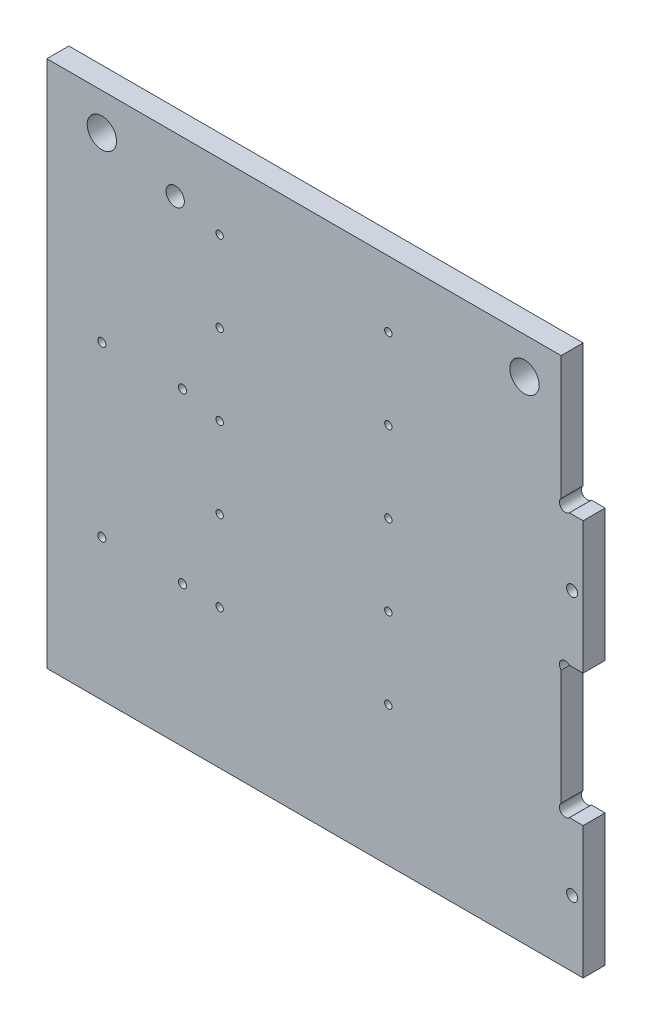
ISO-10303-21;
HEADER;
FILE_DESCRIPTION(('STEP AP214'),'2;1');
FILE_NAME('part.step','',(''),(''),'','','');
FILE_SCHEMA(('AUTOMOTIVE_DESIGN { 1 0 10303 214 1 1 1 1 }'));
ENDSEC;
DATA;
#1=APPLICATION_CONTEXT('core data for automotive mechanical design processes');
#2=APPLICATION_PROTOCOL_DEFINITION('international standard','automotive_design',2000,#1);
#3=PRODUCT_CONTEXT('',#1,'mechanical');
#4=PRODUCT('Part','Part','',(#3));
#5=PRODUCT_RELATED_PRODUCT_CATEGORY('part','',(#4));
#6=PRODUCT_DEFINITION_FORMATION('','',#4);
#7=PRODUCT_DEFINITION_CONTEXT('part definition',#1,'design');
#8=PRODUCT_DEFINITION('design','',#6,#7);
#9=PRODUCT_DEFINITION_SHAPE('','',#8);
#10=(LENGTH_UNIT() NAMED_UNIT(*) SI_UNIT(.MILLI.,.METRE.));
#11=(NAMED_UNIT(*) PLANE_ANGLE_UNIT() SI_UNIT($,.RADIAN.));
#12=(NAMED_UNIT(*) SI_UNIT($,.STERADIAN.) SOLID_ANGLE_UNIT());
#13=UNCERTAINTY_MEASURE_WITH_UNIT(LENGTH_MEASURE(1.E-05),#10,'distance_accuracy_value','');
#14=(GEOMETRIC_REPRESENTATION_CONTEXT(3) GLOBAL_UNCERTAINTY_ASSIGNED_CONTEXT((#13)) GLOBAL_UNIT_ASSIGNED_CONTEXT((#10,
#11,#12)) REPRESENTATION_CONTEXT('',''));
#15=CARTESIAN_POINT('',(0.,0.,0.));
#16=DIRECTION('',(0.,0.,1.));
#17=DIRECTION('',(1.,0.,0.));
#18=AXIS2_PLACEMENT_3D('',#15,#16,#17);
#19=CARTESIAN_POINT('',(0.,0.,6.));
#20=DIRECTION('',(0.,1.,0.));
#21=DIRECTION('',(-1.,0.,0.));
#22=AXIS2_PLACEMENT_3D('',#19,#20,#21);
#23=PLANE('',#22);
#24=DIRECTION('',(1.,0.,0.));
#25=VECTOR('',#24,1.);
#26=CARTESIAN_POINT('',(0.,0.,0.));
#27=LINE('',#26,#25);
#28=CARTESIAN_POINT('',(0.,0.,0.));
#29=VERTEX_POINT('',#28);
#30=CARTESIAN_POINT('',(146.25,0.,0.));
#31=VERTEX_POINT('',#30);
#32=EDGE_CURVE('E235',#29,#31,#27,.T.);
#33=ORIENTED_EDGE('',*,*,#32,.T.);
#34=DIRECTION('',(0.,0.,-1.));
#35=VECTOR('',#34,1.);
#36=CARTESIAN_POINT('',(146.25,0.,6.));
#37=LINE('',#36,#35);
#38=CARTESIAN_POINT('',(146.25,0.,6.));
#39=VERTEX_POINT('',#38);
#40=EDGE_CURVE('E194',#39,#31,#37,.T.);
#41=ORIENTED_EDGE('',*,*,#40,.F.);
#42=DIRECTION('',(1.,0.,0.));
#43=VECTOR('',#42,1.);
#44=CARTESIAN_POINT('',(0.,0.,6.));
#45=LINE('',#44,#43);
#46=CARTESIAN_POINT('',(0.,0.,6.));
#47=VERTEX_POINT('',#46);
#48=EDGE_CURVE('E156',#47,#39,#45,.T.);
#49=ORIENTED_EDGE('',*,*,#48,.F.);
#50=DIRECTION('',(0.,0.,-1.));
#51=VECTOR('',#50,1.);
#52=CARTESIAN_POINT('',(0.,0.,6.));
#53=LINE('',#52,#51);
#54=EDGE_CURVE('E176',#47,#29,#53,.T.);
#55=ORIENTED_EDGE('',*,*,#54,.T.);
#56=EDGE_LOOP('',(#33,#41,#49,#55));
#57=FACE_BOUND('',#56,.T.);
#58=ADVANCED_FACE('F26',(#57),#23,.F.);
#59=CARTESIAN_POINT('',(146.25,36.,6.));
#60=DIRECTION('',(-1.,0.,0.));
#61=DIRECTION('',(0.,0.,1.));
#62=AXIS2_PLACEMENT_3D('',#59,#60,#61);
#63=PLANE('',#62);
#64=DIRECTION('',(0.,1.,0.));
#65=VECTOR('',#64,1.);
#66=CARTESIAN_POINT('',(146.25,36.,0.));
#67=LINE('',#66,#65);
#68=CARTESIAN_POINT('',(146.25,36.,0.));
#69=VERTEX_POINT('',#68);
#70=EDGE_CURVE('E142',#31,#69,#67,.T.);
#71=ORIENTED_EDGE('',*,*,#70,.T.);
#72=DIRECTION('',(0.,0.,-1.));
#73=VECTOR('',#72,1.);
#74=CARTESIAN_POINT('',(146.25,36.,6.));
#75=LINE('',#74,#73);
#76=CARTESIAN_POINT('',(146.25,36.,6.));
#77=VERTEX_POINT('',#76);
#78=EDGE_CURVE('E191',#77,#69,#75,.T.);
#79=ORIENTED_EDGE('',*,*,#78,.F.);
#80=DIRECTION('',(0.,1.,0.));
#81=VECTOR('',#80,1.);
#82=CARTESIAN_POINT('',(146.25,36.,6.));
#83=LINE('',#82,#81);
#84=EDGE_CURVE('E158',#39,#77,#83,.T.);
#85=ORIENTED_EDGE('',*,*,#84,.F.);
#86=ORIENTED_EDGE('',*,*,#40,.T.);
#87=EDGE_LOOP('',(#71,#79,#85,#86));
#88=FACE_BOUND('',#87,.T.);
#89=ADVANCED_FACE('F239',(#88),#63,.F.);
#90=CARTESIAN_POINT('',(140.25,36.,6.));
#91=DIRECTION('',(0.,-1.,0.));
#92=DIRECTION('',(1.,0.,0.));
#93=AXIS2_PLACEMENT_3D('',#90,#91,#92);
#94=PLANE('',#93);
#95=DIRECTION('',(-1.,0.,0.));
#96=VECTOR('',#95,1.);
#97=CARTESIAN_POINT('',(140.25,36.,0.));
#98=LINE('',#97,#96);
#99=CARTESIAN_POINT('',(142.512741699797,36.,0.));
#100=VERTEX_POINT('',#99);
#101=EDGE_CURVE('E138',#69,#100,#98,.T.);
#102=ORIENTED_EDGE('',*,*,#101,.T.);
#103=DIRECTION('',(0.,0.,1.));
#104=VECTOR('',#103,1.);
#105=CARTESIAN_POINT('',(142.512741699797,36.,0.));
#106=LINE('',#105,#104);
#107=CARTESIAN_POINT('',(142.512741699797,36.,6.));
#108=VERTEX_POINT('',#107);
#109=EDGE_CURVE('E126',#100,#108,#106,.T.);
#110=ORIENTED_EDGE('',*,*,#109,.T.);
#111=DIRECTION('',(-1.,0.,0.));
#112=VECTOR('',#111,1.);
#113=CARTESIAN_POINT('',(140.25,36.,6.));
#114=LINE('',#113,#112);
#115=EDGE_CURVE('E160',#77,#108,#114,.T.);
#116=ORIENTED_EDGE('',*,*,#115,.F.);
#117=ORIENTED_EDGE('',*,*,#78,.T.);
#118=EDGE_LOOP('',(#102,#110,#116,#117));
#119=FACE_BOUND('',#118,.T.);
#120=ADVANCED_FACE('F244',(#119),#94,.F.);
#121=CARTESIAN_POINT('',(140.25,72.,6.));
#122=DIRECTION('',(-1.,0.,0.));
#123=DIRECTION('',(0.,0.,1.));
#124=AXIS2_PLACEMENT_3D('',#121,#122,#123);
#125=PLANE('',#124);
#126=DIRECTION('',(0.,1.,0.));
#127=VECTOR('',#126,1.);
#128=CARTESIAN_POINT('',(140.25,72.,6.));
#129=LINE('',#128,#127);
#130=CARTESIAN_POINT('',(140.25,38.262741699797,6.));
#131=VERTEX_POINT('',#130);
#132=CARTESIAN_POINT('',(140.25,69.737258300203,6.));
#133=VERTEX_POINT('',#132);
#134=EDGE_CURVE('E131',#131,#133,#129,.T.);
#135=ORIENTED_EDGE('',*,*,#134,.F.);
#136=DIRECTION('',(0.,0.,1.));
#137=VECTOR('',#136,1.);
#138=CARTESIAN_POINT('',(140.25,38.262741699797,0.));
#139=LINE('',#138,#137);
#140=CARTESIAN_POINT('',(140.25,38.262741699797,0.));
#141=VERTEX_POINT('',#140);
#142=EDGE_CURVE('E123',#131,#141,#139,.F.);
#143=ORIENTED_EDGE('',*,*,#142,.T.);
#144=DIRECTION('',(0.,1.,0.));
#145=VECTOR('',#144,1.);
#146=CARTESIAN_POINT('',(140.25,72.,0.));
#147=LINE('',#146,#145);
#148=CARTESIAN_POINT('',(140.25,69.737258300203,0.));
#149=VERTEX_POINT('',#148);
#150=EDGE_CURVE('E40',#141,#149,#147,.T.);
#151=ORIENTED_EDGE('',*,*,#150,.T.);
#152=DIRECTION('',(0.,0.,1.));
#153=VECTOR('',#152,1.);
#154=CARTESIAN_POINT('',(140.25,69.737258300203,0.));
#155=LINE('',#154,#153);
#156=EDGE_CURVE('E205',#149,#133,#155,.T.);
#157=ORIENTED_EDGE('',*,*,#156,.T.);
#158=EDGE_LOOP('',(#135,#143,#151,#157));
#159=FACE_BOUND('',#158,.T.);
#160=ADVANCED_FACE('F130',(#159),#125,.F.);
#161=CARTESIAN_POINT('',(146.25,72.,6.));
#162=DIRECTION('',(0.,1.,0.));
#163=DIRECTION('',(-1.,0.,0.));
#164=AXIS2_PLACEMENT_3D('',#161,#162,#163);
#165=PLANE('',#164);
#166=DIRECTION('',(1.,0.,0.));
#167=VECTOR('',#166,1.);
#168=CARTESIAN_POINT('',(146.25,72.,6.));
#169=LINE('',#168,#167);
#170=CARTESIAN_POINT('',(142.512741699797,72.,6.));
#171=VERTEX_POINT('',#170);
#172=CARTESIAN_POINT('',(146.25,72.,6.));
#173=VERTEX_POINT('',#172);
#174=EDGE_CURVE('E164',#171,#173,#169,.T.);
#175=ORIENTED_EDGE('',*,*,#174,.F.);
#176=DIRECTION('',(0.,0.,1.));
#177=VECTOR('',#176,1.);
#178=CARTESIAN_POINT('',(142.512741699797,72.,0.));
#179=LINE('',#178,#177);
#180=CARTESIAN_POINT('',(142.512741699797,72.,0.));
#181=VERTEX_POINT('',#180);
#182=EDGE_CURVE('E203',#171,#181,#179,.F.);
#183=ORIENTED_EDGE('',*,*,#182,.T.);
#184=DIRECTION('',(1.,0.,0.));
#185=VECTOR('',#184,1.);
#186=CARTESIAN_POINT('',(146.25,72.,0.));
#187=LINE('',#186,#185);
#188=CARTESIAN_POINT('',(146.25,72.,0.));
#189=VERTEX_POINT('',#188);
#190=EDGE_CURVE('E137',#181,#189,#187,.T.);
#191=ORIENTED_EDGE('',*,*,#190,.T.);
#192=DIRECTION('',(0.,0.,-1.));
#193=VECTOR('',#192,1.);
#194=CARTESIAN_POINT('',(146.25,72.,6.));
#195=LINE('',#194,#193);
#196=EDGE_CURVE('E188',#173,#189,#195,.T.);
#197=ORIENTED_EDGE('',*,*,#196,.F.);
#198=EDGE_LOOP('',(#175,#183,#191,#197));
#199=FACE_BOUND('',#198,.T.);
#200=ADVANCED_FACE('F207',(#199),#165,.F.);
#201=CARTESIAN_POINT('',(146.25,108.,6.));
#202=DIRECTION('',(-1.,0.,0.));
#203=DIRECTION('',(0.,0.,1.));
#204=AXIS2_PLACEMENT_3D('',#201,#202,#203);
#205=PLANE('',#204);
#206=DIRECTION('',(0.,1.,0.));
#207=VECTOR('',#206,1.);
#208=CARTESIAN_POINT('',(146.25,108.,0.));
#209=LINE('',#208,#207);
#210=CARTESIAN_POINT('',(146.25,108.,0.));
#211=VERTEX_POINT('',#210);
#212=EDGE_CURVE('E140',#189,#211,#209,.T.);
#213=ORIENTED_EDGE('',*,*,#212,.T.);
#214=DIRECTION('',(0.,0.,-1.));
#215=VECTOR('',#214,1.);
#216=CARTESIAN_POINT('',(146.25,108.,6.));
#217=LINE('',#216,#215);
#218=CARTESIAN_POINT('',(146.25,108.,6.));
#219=VERTEX_POINT('',#218);
#220=EDGE_CURVE('E185',#219,#211,#217,.T.);
#221=ORIENTED_EDGE('',*,*,#220,.F.);
#222=DIRECTION('',(0.,1.,0.));
#223=VECTOR('',#222,1.);
#224=CARTESIAN_POINT('',(146.25,108.,6.));
#225=LINE('',#224,#223);
#226=EDGE_CURVE('E166',#173,#219,#225,.T.);
#227=ORIENTED_EDGE('',*,*,#226,.F.);
#228=ORIENTED_EDGE('',*,*,#196,.T.);
#229=EDGE_LOOP('',(#213,#221,#227,#228));
#230=FACE_BOUND('',#229,.T.);
#231=ADVANCED_FACE('F216',(#230),#205,.F.);
#232=CARTESIAN_POINT('',(140.25,108.,6.));
#233=DIRECTION('',(0.,-1.,0.));
#234=DIRECTION('',(1.,0.,0.));
#235=AXIS2_PLACEMENT_3D('',#232,#233,#234);
#236=PLANE('',#235);
#237=DIRECTION('',(-1.,0.,0.));
#238=VECTOR('',#237,1.);
#239=CARTESIAN_POINT('',(140.25,108.,0.));
#240=LINE('',#239,#238);
#241=CARTESIAN_POINT('',(142.512741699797,108.,0.));
#242=VERTEX_POINT('',#241);
#243=EDGE_CURVE('E147',#211,#242,#240,.T.);
#244=ORIENTED_EDGE('',*,*,#243,.T.);
#245=DIRECTION('',(0.,0.,1.));
#246=VECTOR('',#245,1.);
#247=CARTESIAN_POINT('',(142.512741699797,108.,0.));
#248=LINE('',#247,#246);
#249=CARTESIAN_POINT('',(142.512741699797,108.,6.));
#250=VERTEX_POINT('',#249);
#251=EDGE_CURVE('E222',#242,#250,#248,.T.);
#252=ORIENTED_EDGE('',*,*,#251,.T.);
#253=DIRECTION('',(-1.,0.,0.));
#254=VECTOR('',#253,1.);
#255=CARTESIAN_POINT('',(140.25,108.,6.));
#256=LINE('',#255,#254);
#257=EDGE_CURVE('E168',#219,#250,#256,.T.);
#258=ORIENTED_EDGE('',*,*,#257,.F.);
#259=ORIENTED_EDGE('',*,*,#220,.T.);
#260=EDGE_LOOP('',(#244,#252,#258,#259));
#261=FACE_BOUND('',#260,.T.);
#262=ADVANCED_FACE('F220',(#261),#236,.F.);
#263=CARTESIAN_POINT('',(140.25,144.,6.));
#264=DIRECTION('',(-1.,0.,0.));
#265=DIRECTION('',(0.,0.,1.));
#266=AXIS2_PLACEMENT_3D('',#263,#264,#265);
#267=PLANE('',#266);
#268=DIRECTION('',(0.,1.,0.));
#269=VECTOR('',#268,1.);
#270=CARTESIAN_POINT('',(140.25,144.,6.));
#271=LINE('',#270,#269);
#272=CARTESIAN_POINT('',(140.25,110.262741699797,6.));
#273=VERTEX_POINT('',#272);
#274=CARTESIAN_POINT('',(140.25,144.,6.));
#275=VERTEX_POINT('',#274);
#276=EDGE_CURVE('E171',#273,#275,#271,.T.);
#277=ORIENTED_EDGE('',*,*,#276,.F.);
#278=DIRECTION('',(0.,0.,1.));
#279=VECTOR('',#278,1.);
#280=CARTESIAN_POINT('',(140.25,110.262741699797,0.));
#281=LINE('',#280,#279);
#282=CARTESIAN_POINT('',(140.25,110.262741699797,0.));
#283=VERTEX_POINT('',#282);
#284=EDGE_CURVE('E231',#273,#283,#281,.F.);
#285=ORIENTED_EDGE('',*,*,#284,.T.);
#286=DIRECTION('',(0.,1.,0.));
#287=VECTOR('',#286,1.);
#288=CARTESIAN_POINT('',(140.25,144.,0.));
#289=LINE('',#288,#287);
#290=CARTESIAN_POINT('',(140.25,144.,0.));
#291=VERTEX_POINT('',#290);
#292=EDGE_CURVE('E150',#283,#291,#289,.T.);
#293=ORIENTED_EDGE('',*,*,#292,.T.);
#294=DIRECTION('',(0.,0.,-1.));
#295=VECTOR('',#294,1.);
#296=CARTESIAN_POINT('',(140.25,144.,6.));
#297=LINE('',#296,#295);
#298=EDGE_CURVE('E182',#275,#291,#297,.T.);
#299=ORIENTED_EDGE('',*,*,#298,.F.);
#300=EDGE_LOOP('',(#277,#285,#293,#299));
#301=FACE_BOUND('',#300,.T.);
#302=ADVANCED_FACE('F259',(#301),#267,.F.);
#303=CARTESIAN_POINT('',(0.,144.,6.));
#304=DIRECTION('',(0.,-1.,0.));
#305=DIRECTION('',(1.,0.,0.));
#306=AXIS2_PLACEMENT_3D('',#303,#304,#305);
#307=PLANE('',#306);
#308=DIRECTION('',(-1.,0.,0.));
#309=VECTOR('',#308,1.);
#310=CARTESIAN_POINT('',(0.,144.,0.));
#311=LINE('',#310,#309);
#312=CARTESIAN_POINT('',(0.,144.,0.));
#313=VERTEX_POINT('',#312);
#314=EDGE_CURVE('E152',#291,#313,#311,.T.);
#315=ORIENTED_EDGE('',*,*,#314,.T.);
#316=DIRECTION('',(0.,0.,-1.));
#317=VECTOR('',#316,1.);
#318=CARTESIAN_POINT('',(0.,144.,6.));
#319=LINE('',#318,#317);
#320=CARTESIAN_POINT('',(0.,144.,6.));
#321=VERTEX_POINT('',#320);
#322=EDGE_CURVE('E179',#321,#313,#319,.T.);
#323=ORIENTED_EDGE('',*,*,#322,.F.);
#324=DIRECTION('',(-1.,0.,0.));
#325=VECTOR('',#324,1.);
#326=CARTESIAN_POINT('',(0.,144.,6.));
#327=LINE('',#326,#325);
#328=EDGE_CURVE('E173',#275,#321,#327,.T.);
#329=ORIENTED_EDGE('',*,*,#328,.F.);
#330=ORIENTED_EDGE('',*,*,#298,.T.);
#331=EDGE_LOOP('',(#315,#323,#329,#330));
#332=FACE_BOUND('',#331,.T.);
#333=ADVANCED_FACE('F255',(#332),#307,.F.);
#334=CARTESIAN_POINT('',(0.,0.,6.));
#335=DIRECTION('',(1.,0.,0.));
#336=DIRECTION('',(0.,0.,-1.));
#337=AXIS2_PLACEMENT_3D('',#334,#335,#336);
#338=PLANE('',#337);
#339=DIRECTION('',(0.,-1.,0.));
#340=VECTOR('',#339,1.);
#341=CARTESIAN_POINT('',(0.,0.,0.));
#342=LINE('',#341,#340);
#343=EDGE_CURVE('E154',#313,#29,#342,.T.);
#344=ORIENTED_EDGE('',*,*,#343,.T.);
#345=ORIENTED_EDGE('',*,*,#54,.F.);
#346=DIRECTION('',(0.,-1.,0.));
#347=VECTOR('',#346,1.);
#348=CARTESIAN_POINT('',(0.,0.,6.));
#349=LINE('',#348,#347);
#350=EDGE_CURVE('E48',#321,#47,#349,.T.);
#351=ORIENTED_EDGE('',*,*,#350,.F.);
#352=ORIENTED_EDGE('',*,*,#322,.T.);
#353=EDGE_LOOP('',(#344,#345,#351,#352));
#354=FACE_BOUND('',#353,.T.);
#355=ADVANCED_FACE('F251',(#354),#338,.F.);
#356=CARTESIAN_POINT('',(146.25,0.,6.));
#357=DIRECTION('',(0.,0.,-1.));
#358=DIRECTION('',(-1.,0.,0.));
#359=AXIS2_PLACEMENT_3D('',#356,#357,#358);
#360=PLANE('',#359);
#361=CARTESIAN_POINT('',(35.,129.,6.));
#362=DIRECTION('',(0.,0.,-1.));
#363=DIRECTION('',(-1.,0.,0.));
#364=AXIS2_PLACEMENT_3D('',#361,#362,#363);
#365=CIRCLE('',#364,2.5);
#366=CARTESIAN_POINT('',(32.5,129.,6.));
#367=VERTEX_POINT('',#366);
#368=EDGE_CURVE('E302',#367,#367,#365,.T.);
#369=ORIENTED_EDGE('',*,*,#368,.T.);
#370=EDGE_LOOP('',(#369));
#371=FACE_BOUND('',#370,.T.);
#372=CARTESIAN_POINT('',(15.,38.5,6.));
#373=DIRECTION('',(0.,0.,-1.));
#374=DIRECTION('',(-1.,0.,0.));
#375=AXIS2_PLACEMENT_3D('',#372,#373,#374);
#376=CIRCLE('',#375,1.1);
#377=CARTESIAN_POINT('',(13.9,38.5,6.));
#378=VERTEX_POINT('',#377);
#379=EDGE_CURVE('E306',#378,#378,#376,.T.);
#380=ORIENTED_EDGE('',*,*,#379,.T.);
#381=EDGE_LOOP('',(#380));
#382=FACE_BOUND('',#381,.T.);
#383=CARTESIAN_POINT('',(37.,38.5,6.));
#384=DIRECTION('',(0.,0.,-1.));
#385=DIRECTION('',(-1.,0.,0.));
#386=AXIS2_PLACEMENT_3D('',#383,#384,#385);
#387=CIRCLE('',#386,1.1);
#388=CARTESIAN_POINT('',(35.9,38.5,6.));
#389=VERTEX_POINT('',#388);
#390=EDGE_CURVE('E310',#389,#389,#387,.T.);
#391=ORIENTED_EDGE('',*,*,#390,.T.);
#392=EDGE_LOOP('',(#391));
#393=FACE_BOUND('',#392,.T.);
#394=CARTESIAN_POINT('',(37.,84.5,6.));
#395=DIRECTION('',(0.,0.,-1.));
#396=DIRECTION('',(-1.,0.,0.));
#397=AXIS2_PLACEMENT_3D('',#394,#395,#396);
#398=CIRCLE('',#397,1.1);
#399=CARTESIAN_POINT('',(35.9,84.5,6.));
#400=VERTEX_POINT('',#399);
#401=EDGE_CURVE('E314',#400,#400,#398,.T.);
#402=ORIENTED_EDGE('',*,*,#401,.T.);
#403=EDGE_LOOP('',(#402));
#404=FACE_BOUND('',#403,.T.);
#405=CARTESIAN_POINT('',(15.,84.5,6.));
#406=DIRECTION('',(0.,0.,-1.));
#407=DIRECTION('',(-1.,0.,0.));
#408=AXIS2_PLACEMENT_3D('',#405,#406,#407);
#409=CIRCLE('',#408,1.1);
#410=CARTESIAN_POINT('',(13.9,84.5,6.));
#411=VERTEX_POINT('',#410);
#412=EDGE_CURVE('E318',#411,#411,#409,.T.);
#413=ORIENTED_EDGE('',*,*,#412,.T.);
#414=EDGE_LOOP('',(#413));
#415=FACE_BOUND('',#414,.T.);
#416=CARTESIAN_POINT('',(143.25,18.,6.));
#417=DIRECTION('',(0.,0.,1.));
#418=DIRECTION('',(1.,0.,0.));
#419=AXIS2_PLACEMENT_3D('',#416,#417,#418);
#420=CIRCLE('',#419,1.5);
#421=CARTESIAN_POINT('',(144.75,18.,6.));
#422=VERTEX_POINT('',#421);
#423=EDGE_CURVE('E322',#422,#422,#420,.T.);
#424=ORIENTED_EDGE('',*,*,#423,.F.);
#425=EDGE_LOOP('',(#424));
#426=FACE_BOUND('',#425,.T.);
#427=CARTESIAN_POINT('',(143.25,90.,6.));
#428=DIRECTION('',(0.,0.,1.));
#429=DIRECTION('',(1.,0.,0.));
#430=AXIS2_PLACEMENT_3D('',#427,#428,#429);
#431=CIRCLE('',#430,1.5);
#432=CARTESIAN_POINT('',(144.75,90.,6.));
#433=VERTEX_POINT('',#432);
#434=EDGE_CURVE('E326',#433,#433,#431,.T.);
#435=ORIENTED_EDGE('',*,*,#434,.F.);
#436=EDGE_LOOP('',(#435));
#437=FACE_BOUND('',#436,.T.);
#438=CARTESIAN_POINT('',(47.125,38.,6.));
#439=DIRECTION('',(0.,0.,1.));
#440=DIRECTION('',(1.,0.,0.));
#441=AXIS2_PLACEMENT_3D('',#438,#439,#440);
#442=CIRCLE('',#441,0.999999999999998);
#443=CARTESIAN_POINT('',(48.125,38.,6.));
#444=VERTEX_POINT('',#443);
#445=EDGE_CURVE('E330',#444,#444,#442,.T.);
#446=ORIENTED_EDGE('',*,*,#445,.F.);
#447=EDGE_LOOP('',(#446));
#448=FACE_BOUND('',#447,.T.);
#449=CARTESIAN_POINT('',(93.125,38.,6.));
#450=DIRECTION('',(0.,0.,1.));
#451=DIRECTION('',(1.,0.,0.));
#452=AXIS2_PLACEMENT_3D('',#449,#450,#451);
#453=CIRCLE('',#452,0.999999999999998);
#454=CARTESIAN_POINT('',(94.125,38.,6.));
#455=VERTEX_POINT('',#454);
#456=EDGE_CURVE('E334',#455,#455,#453,.T.);
#457=ORIENTED_EDGE('',*,*,#456,.F.);
#458=EDGE_LOOP('',(#457));
#459=FACE_BOUND('',#458,.T.);
#460=CARTESIAN_POINT('',(93.125,104.,6.));
#461=DIRECTION('',(0.,0.,1.));
#462=DIRECTION('',(1.,0.,0.));
#463=AXIS2_PLACEMENT_3D('',#460,#461,#462);
#464=CIRCLE('',#463,0.999999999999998);
#465=CARTESIAN_POINT('',(94.125,104.,6.));
#466=VERTEX_POINT('',#465);
#467=EDGE_CURVE('E338',#466,#466,#464,.T.);
#468=ORIENTED_EDGE('',*,*,#467,.F.);
#469=EDGE_LOOP('',(#468));
#470=FACE_BOUND('',#469,.T.);
#471=CARTESIAN_POINT('',(93.125,82.,6.));
#472=DIRECTION('',(0.,0.,1.));
#473=DIRECTION('',(1.,0.,0.));
#474=AXIS2_PLACEMENT_3D('',#471,#472,#473);
#475=CIRCLE('',#474,0.999999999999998);
#476=CARTESIAN_POINT('',(94.125,82.,6.));
#477=VERTEX_POINT('',#476);
#478=EDGE_CURVE('E342',#477,#477,#475,.T.);
#479=ORIENTED_EDGE('',*,*,#478,.F.);
#480=EDGE_LOOP('',(#479));
#481=FACE_BOUND('',#480,.T.);
#482=CARTESIAN_POINT('',(93.125,60.,6.));
#483=DIRECTION('',(0.,0.,1.));
#484=DIRECTION('',(1.,0.,0.));
#485=AXIS2_PLACEMENT_3D('',#482,#483,#484);
#486=CIRCLE('',#485,0.999999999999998);
#487=CARTESIAN_POINT('',(94.125,60.,6.));
#488=VERTEX_POINT('',#487);
#489=EDGE_CURVE('E346',#488,#488,#486,.T.);
#490=ORIENTED_EDGE('',*,*,#489,.F.);
#491=EDGE_LOOP('',(#490));
#492=FACE_BOUND('',#491,.T.);
#493=CARTESIAN_POINT('',(47.125,60.,6.));
#494=DIRECTION('',(0.,0.,1.));
#495=DIRECTION('',(1.,0.,0.));
#496=AXIS2_PLACEMENT_3D('',#493,#494,#495);
#497=CIRCLE('',#496,0.999999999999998);
#498=CARTESIAN_POINT('',(48.125,60.,6.));
#499=VERTEX_POINT('',#498);
#500=EDGE_CURVE('E350',#499,#499,#497,.T.);
#501=ORIENTED_EDGE('',*,*,#500,.F.);
#502=EDGE_LOOP('',(#501));
#503=FACE_BOUND('',#502,.T.);
#504=CARTESIAN_POINT('',(47.125,82.,6.));
#505=DIRECTION('',(0.,0.,1.));
#506=DIRECTION('',(1.,0.,0.));
#507=AXIS2_PLACEMENT_3D('',#504,#505,#506);
#508=CIRCLE('',#507,0.999999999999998);
#509=CARTESIAN_POINT('',(48.125,82.,6.));
#510=VERTEX_POINT('',#509);
#511=EDGE_CURVE('E354',#510,#510,#508,.T.);
#512=ORIENTED_EDGE('',*,*,#511,.F.);
#513=EDGE_LOOP('',(#512));
#514=FACE_BOUND('',#513,.T.);
#515=CARTESIAN_POINT('',(47.125,104.,6.));
#516=DIRECTION('',(0.,0.,1.));
#517=DIRECTION('',(1.,0.,0.));
#518=AXIS2_PLACEMENT_3D('',#515,#516,#517);
#519=CIRCLE('',#518,0.999999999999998);
#520=CARTESIAN_POINT('',(48.125,104.,6.));
#521=VERTEX_POINT('',#520);
#522=EDGE_CURVE('E358',#521,#521,#519,.T.);
#523=ORIENTED_EDGE('',*,*,#522,.F.);
#524=EDGE_LOOP('',(#523));
#525=FACE_BOUND('',#524,.T.);
#526=CARTESIAN_POINT('',(47.125,126.,6.));
#527=DIRECTION('',(0.,0.,1.));
#528=DIRECTION('',(1.,0.,0.));
#529=AXIS2_PLACEMENT_3D('',#526,#527,#528);
#530=CIRCLE('',#529,0.999999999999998);
#531=CARTESIAN_POINT('',(48.125,126.,6.));
#532=VERTEX_POINT('',#531);
#533=EDGE_CURVE('E362',#532,#532,#530,.T.);
#534=ORIENTED_EDGE('',*,*,#533,.F.);
#535=EDGE_LOOP('',(#534));
#536=FACE_BOUND('',#535,.T.);
#537=CARTESIAN_POINT('',(93.125,126.,6.));
#538=DIRECTION('',(0.,0.,1.));
#539=DIRECTION('',(1.,0.,0.));
#540=AXIS2_PLACEMENT_3D('',#537,#538,#539);
#541=CIRCLE('',#540,0.999999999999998);
#542=CARTESIAN_POINT('',(94.125,126.,6.));
#543=VERTEX_POINT('',#542);
#544=EDGE_CURVE('E366',#543,#543,#541,.T.);
#545=ORIENTED_EDGE('',*,*,#544,.F.);
#546=EDGE_LOOP('',(#545));
#547=FACE_BOUND('',#546,.T.);
#548=CARTESIAN_POINT('',(130.25,134.,6.));
#549=DIRECTION('',(0.,0.,1.));
#550=DIRECTION('',(1.,0.,0.));
#551=AXIS2_PLACEMENT_3D('',#548,#549,#550);
#552=CIRCLE('',#551,3.99999999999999);
#553=CARTESIAN_POINT('',(134.25,134.,6.));
#554=VERTEX_POINT('',#553);
#555=EDGE_CURVE('E370',#554,#554,#552,.T.);
#556=ORIENTED_EDGE('',*,*,#555,.F.);
#557=EDGE_LOOP('',(#556));
#558=FACE_BOUND('',#557,.T.);
#559=CARTESIAN_POINT('',(15.,134.,6.));
#560=DIRECTION('',(0.,0.,1.));
#561=DIRECTION('',(1.,0.,0.));
#562=AXIS2_PLACEMENT_3D('',#559,#560,#561);
#563=CIRCLE('',#562,4.);
#564=CARTESIAN_POINT('',(19.,134.,6.));
#565=VERTEX_POINT('',#564);
#566=EDGE_CURVE('E373',#565,#565,#563,.T.);
#567=ORIENTED_EDGE('',*,*,#566,.F.);
#568=EDGE_LOOP('',(#567));
#569=FACE_BOUND('',#568,.T.);
#570=ORIENTED_EDGE('',*,*,#115,.T.);
#571=CARTESIAN_POINT('',(141.381370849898,37.1313708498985,6.));
#572=DIRECTION('',(0.,0.,1.));
#573=DIRECTION('',(1.,0.,0.));
#574=AXIS2_PLACEMENT_3D('',#571,#572,#573);
#575=CIRCLE('',#574,1.60000000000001);
#576=EDGE_CURVE('E132',#131,#108,#575,.T.);
#577=ORIENTED_EDGE('',*,*,#576,.F.);
#578=ORIENTED_EDGE('',*,*,#134,.T.);
#579=CARTESIAN_POINT('',(141.381370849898,70.8686291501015,6.));
#580=DIRECTION('',(0.,0.,1.));
#581=DIRECTION('',(1.,0.,0.));
#582=AXIS2_PLACEMENT_3D('',#579,#580,#581);
#583=CIRCLE('',#582,1.59999999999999);
#584=EDGE_CURVE('E209',#171,#133,#583,.T.);
#585=ORIENTED_EDGE('',*,*,#584,.F.);
#586=ORIENTED_EDGE('',*,*,#174,.T.);
#587=ORIENTED_EDGE('',*,*,#226,.T.);
#588=ORIENTED_EDGE('',*,*,#257,.T.);
#589=CARTESIAN_POINT('',(141.381370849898,109.131370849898,6.));
#590=DIRECTION('',(0.,0.,1.));
#591=DIRECTION('',(1.,0.,0.));
#592=AXIS2_PLACEMENT_3D('',#589,#590,#591);
#593=CIRCLE('',#592,1.60000000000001);
#594=EDGE_CURVE('E224',#273,#250,#593,.T.);
#595=ORIENTED_EDGE('',*,*,#594,.F.);
#596=ORIENTED_EDGE('',*,*,#276,.T.);
#597=ORIENTED_EDGE('',*,*,#328,.T.);
#598=ORIENTED_EDGE('',*,*,#350,.T.);
#599=ORIENTED_EDGE('',*,*,#48,.T.);
#600=ORIENTED_EDGE('',*,*,#84,.T.);
#601=EDGE_LOOP('',(#570,#577,#578,#585,#586,#587,#588,#595,#596,#597,#598,#599,#600));
#602=FACE_BOUND('',#601,.T.);
#603=ADVANCED_FACE('F223',(#371,#382,#393,#404,#415,#426,#437,#448,#459,#470,#481,#492,#503,
#514,#525,#536,#547,#558,#569,#602),#360,.F.);
#604=CARTESIAN_POINT('',(146.25,0.,0.));
#605=DIRECTION('',(0.,0.,-1.));
#606=DIRECTION('',(-1.,0.,0.));
#607=AXIS2_PLACEMENT_3D('',#604,#605,#606);
#608=PLANE('',#607);
#609=CARTESIAN_POINT('',(35.,129.,0.));
#610=DIRECTION('',(0.,0.,-1.));
#611=DIRECTION('',(-1.,0.,0.));
#612=AXIS2_PLACEMENT_3D('',#609,#610,#611);
#613=CIRCLE('',#612,2.5);
#614=CARTESIAN_POINT('',(32.5,129.,0.));
#615=VERTEX_POINT('',#614);
#616=EDGE_CURVE('E450',#615,#615,#613,.T.);
#617=ORIENTED_EDGE('',*,*,#616,.F.);
#618=EDGE_LOOP('',(#617));
#619=FACE_BOUND('',#618,.T.);
#620=CARTESIAN_POINT('',(15.,38.5,0.));
#621=DIRECTION('',(0.,0.,-1.));
#622=DIRECTION('',(-1.,0.,0.));
#623=AXIS2_PLACEMENT_3D('',#620,#621,#622);
#624=CIRCLE('',#623,1.1);
#625=CARTESIAN_POINT('',(13.9,38.5,0.));
#626=VERTEX_POINT('',#625);
#627=EDGE_CURVE('E446',#626,#626,#624,.T.);
#628=ORIENTED_EDGE('',*,*,#627,.F.);
#629=EDGE_LOOP('',(#628));
#630=FACE_BOUND('',#629,.T.);
#631=CARTESIAN_POINT('',(37.,38.5,0.));
#632=DIRECTION('',(0.,0.,-1.));
#633=DIRECTION('',(-1.,0.,0.));
#634=AXIS2_PLACEMENT_3D('',#631,#632,#633);
#635=CIRCLE('',#634,1.1);
#636=CARTESIAN_POINT('',(35.9,38.5,0.));
#637=VERTEX_POINT('',#636);
#638=EDGE_CURVE('E442',#637,#637,#635,.T.);
#639=ORIENTED_EDGE('',*,*,#638,.F.);
#640=EDGE_LOOP('',(#639));
#641=FACE_BOUND('',#640,.T.);
#642=CARTESIAN_POINT('',(37.,84.5,0.));
#643=DIRECTION('',(0.,0.,-1.));
#644=DIRECTION('',(-1.,0.,0.));
#645=AXIS2_PLACEMENT_3D('',#642,#643,#644);
#646=CIRCLE('',#645,1.1);
#647=CARTESIAN_POINT('',(35.9,84.5,0.));
#648=VERTEX_POINT('',#647);
#649=EDGE_CURVE('E438',#648,#648,#646,.T.);
#650=ORIENTED_EDGE('',*,*,#649,.F.);
#651=EDGE_LOOP('',(#650));
#652=FACE_BOUND('',#651,.T.);
#653=CARTESIAN_POINT('',(15.,84.5,0.));
#654=DIRECTION('',(0.,0.,-1.));
#655=DIRECTION('',(-1.,0.,0.));
#656=AXIS2_PLACEMENT_3D('',#653,#654,#655);
#657=CIRCLE('',#656,1.1);
#658=CARTESIAN_POINT('',(13.9,84.5,0.));
#659=VERTEX_POINT('',#658);
#660=EDGE_CURVE('E434',#659,#659,#657,.T.);
#661=ORIENTED_EDGE('',*,*,#660,.F.);
#662=EDGE_LOOP('',(#661));
#663=FACE_BOUND('',#662,.T.);
#664=CARTESIAN_POINT('',(143.25,18.,0.));
#665=DIRECTION('',(0.,0.,1.));
#666=DIRECTION('',(1.,0.,0.));
#667=AXIS2_PLACEMENT_3D('',#664,#665,#666);
#668=CIRCLE('',#667,1.5);
#669=CARTESIAN_POINT('',(144.75,18.,0.));
#670=VERTEX_POINT('',#669);
#671=EDGE_CURVE('E429',#670,#670,#668,.T.);
#672=ORIENTED_EDGE('',*,*,#671,.T.);
#673=EDGE_LOOP('',(#672));
#674=FACE_BOUND('',#673,.T.);
#675=CARTESIAN_POINT('',(143.25,90.,0.));
#676=DIRECTION('',(0.,0.,1.));
#677=DIRECTION('',(1.,0.,0.));
#678=AXIS2_PLACEMENT_3D('',#675,#676,#677);
#679=CIRCLE('',#678,1.5);
#680=CARTESIAN_POINT('',(144.75,90.,0.));
#681=VERTEX_POINT('',#680);
#682=EDGE_CURVE('E425',#681,#681,#679,.T.);
#683=ORIENTED_EDGE('',*,*,#682,.T.);
#684=EDGE_LOOP('',(#683));
#685=FACE_BOUND('',#684,.T.);
#686=CARTESIAN_POINT('',(47.125,38.,0.));
#687=DIRECTION('',(0.,0.,1.));
#688=DIRECTION('',(1.,0.,0.));
#689=AXIS2_PLACEMENT_3D('',#686,#687,#688);
#690=CIRCLE('',#689,0.999999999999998);
#691=CARTESIAN_POINT('',(48.125,38.,0.));
#692=VERTEX_POINT('',#691);
#693=EDGE_CURVE('E421',#692,#692,#690,.T.);
#694=ORIENTED_EDGE('',*,*,#693,.T.);
#695=EDGE_LOOP('',(#694));
#696=FACE_BOUND('',#695,.T.);
#697=CARTESIAN_POINT('',(93.125,38.,0.));
#698=DIRECTION('',(0.,0.,1.));
#699=DIRECTION('',(1.,0.,0.));
#700=AXIS2_PLACEMENT_3D('',#697,#698,#699);
#701=CIRCLE('',#700,0.999999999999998);
#702=CARTESIAN_POINT('',(94.125,38.,0.));
#703=VERTEX_POINT('',#702);
#704=EDGE_CURVE('E417',#703,#703,#701,.T.);
#705=ORIENTED_EDGE('',*,*,#704,.T.);
#706=EDGE_LOOP('',(#705));
#707=FACE_BOUND('',#706,.T.);
#708=CARTESIAN_POINT('',(93.125,104.,0.));
#709=DIRECTION('',(0.,0.,1.));
#710=DIRECTION('',(1.,0.,0.));
#711=AXIS2_PLACEMENT_3D('',#708,#709,#710);
#712=CIRCLE('',#711,0.999999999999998);
#713=CARTESIAN_POINT('',(94.125,104.,0.));
#714=VERTEX_POINT('',#713);
#715=EDGE_CURVE('E413',#714,#714,#712,.T.);
#716=ORIENTED_EDGE('',*,*,#715,.T.);
#717=EDGE_LOOP('',(#716));
#718=FACE_BOUND('',#717,.T.);
#719=CARTESIAN_POINT('',(93.125,82.,0.));
#720=DIRECTION('',(0.,0.,1.));
#721=DIRECTION('',(1.,0.,0.));
#722=AXIS2_PLACEMENT_3D('',#719,#720,#721);
#723=CIRCLE('',#722,0.999999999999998);
#724=CARTESIAN_POINT('',(94.125,82.,0.));
#725=VERTEX_POINT('',#724);
#726=EDGE_CURVE('E409',#725,#725,#723,.T.);
#727=ORIENTED_EDGE('',*,*,#726,.T.);
#728=EDGE_LOOP('',(#727));
#729=FACE_BOUND('',#728,.T.);
#730=CARTESIAN_POINT('',(93.125,60.,0.));
#731=DIRECTION('',(0.,0.,1.));
#732=DIRECTION('',(1.,0.,0.));
#733=AXIS2_PLACEMENT_3D('',#730,#731,#732);
#734=CIRCLE('',#733,0.999999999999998);
#735=CARTESIAN_POINT('',(94.125,60.,0.));
#736=VERTEX_POINT('',#735);
#737=EDGE_CURVE('E405',#736,#736,#734,.T.);
#738=ORIENTED_EDGE('',*,*,#737,.T.);
#739=EDGE_LOOP('',(#738));
#740=FACE_BOUND('',#739,.T.);
#741=CARTESIAN_POINT('',(47.125,60.,0.));
#742=DIRECTION('',(0.,0.,1.));
#743=DIRECTION('',(1.,0.,0.));
#744=AXIS2_PLACEMENT_3D('',#741,#742,#743);
#745=CIRCLE('',#744,0.999999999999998);
#746=CARTESIAN_POINT('',(48.125,60.,0.));
#747=VERTEX_POINT('',#746);
#748=EDGE_CURVE('E401',#747,#747,#745,.T.);
#749=ORIENTED_EDGE('',*,*,#748,.T.);
#750=EDGE_LOOP('',(#749));
#751=FACE_BOUND('',#750,.T.);
#752=CARTESIAN_POINT('',(47.125,82.,0.));
#753=DIRECTION('',(0.,0.,1.));
#754=DIRECTION('',(1.,0.,0.));
#755=AXIS2_PLACEMENT_3D('',#752,#753,#754);
#756=CIRCLE('',#755,0.999999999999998);
#757=CARTESIAN_POINT('',(48.125,82.,0.));
#758=VERTEX_POINT('',#757);
#759=EDGE_CURVE('E397',#758,#758,#756,.T.);
#760=ORIENTED_EDGE('',*,*,#759,.T.);
#761=EDGE_LOOP('',(#760));
#762=FACE_BOUND('',#761,.T.);
#763=CARTESIAN_POINT('',(47.125,104.,0.));
#764=DIRECTION('',(0.,0.,1.));
#765=DIRECTION('',(1.,0.,0.));
#766=AXIS2_PLACEMENT_3D('',#763,#764,#765);
#767=CIRCLE('',#766,0.999999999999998);
#768=CARTESIAN_POINT('',(48.125,104.,0.));
#769=VERTEX_POINT('',#768);
#770=EDGE_CURVE('E393',#769,#769,#767,.T.);
#771=ORIENTED_EDGE('',*,*,#770,.T.);
#772=EDGE_LOOP('',(#771));
#773=FACE_BOUND('',#772,.T.);
#774=CARTESIAN_POINT('',(47.125,126.,0.));
#775=DIRECTION('',(0.,0.,1.));
#776=DIRECTION('',(1.,0.,0.));
#777=AXIS2_PLACEMENT_3D('',#774,#775,#776);
#778=CIRCLE('',#777,0.999999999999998);
#779=CARTESIAN_POINT('',(48.125,126.,0.));
#780=VERTEX_POINT('',#779);
#781=EDGE_CURVE('E389',#780,#780,#778,.T.);
#782=ORIENTED_EDGE('',*,*,#781,.T.);
#783=EDGE_LOOP('',(#782));
#784=FACE_BOUND('',#783,.T.);
#785=CARTESIAN_POINT('',(93.125,126.,0.));
#786=DIRECTION('',(0.,0.,1.));
#787=DIRECTION('',(1.,0.,0.));
#788=AXIS2_PLACEMENT_3D('',#785,#786,#787);
#789=CIRCLE('',#788,0.999999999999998);
#790=CARTESIAN_POINT('',(94.125,126.,0.));
#791=VERTEX_POINT('',#790);
#792=EDGE_CURVE('E385',#791,#791,#789,.T.);
#793=ORIENTED_EDGE('',*,*,#792,.T.);
#794=EDGE_LOOP('',(#793));
#795=FACE_BOUND('',#794,.T.);
#796=CARTESIAN_POINT('',(130.25,134.,0.));
#797=DIRECTION('',(0.,0.,1.));
#798=DIRECTION('',(1.,0.,0.));
#799=AXIS2_PLACEMENT_3D('',#796,#797,#798);
#800=CIRCLE('',#799,3.99999999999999);
#801=CARTESIAN_POINT('',(134.25,134.,0.));
#802=VERTEX_POINT('',#801);
#803=EDGE_CURVE('E376',#802,#802,#800,.T.);
#804=ORIENTED_EDGE('',*,*,#803,.T.);
#805=EDGE_LOOP('',(#804));
#806=FACE_BOUND('',#805,.T.);
#807=CARTESIAN_POINT('',(15.,134.,0.));
#808=DIRECTION('',(0.,0.,1.));
#809=DIRECTION('',(1.,0.,0.));
#810=AXIS2_PLACEMENT_3D('',#807,#808,#809);
#811=CIRCLE('',#810,4.);
#812=CARTESIAN_POINT('',(19.,134.,0.));
#813=VERTEX_POINT('',#812);
#814=EDGE_CURVE('E375',#813,#813,#811,.T.);
#815=ORIENTED_EDGE('',*,*,#814,.T.);
#816=EDGE_LOOP('',(#815));
#817=FACE_BOUND('',#816,.T.);
#818=CARTESIAN_POINT('',(141.381370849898,37.1313708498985,0.));
#819=DIRECTION('',(0.,0.,-1.));
#820=DIRECTION('',(-1.,0.,0.));
#821=AXIS2_PLACEMENT_3D('',#818,#819,#820);
#822=CIRCLE('',#821,1.60000000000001);
#823=EDGE_CURVE('E11',#100,#141,#822,.T.);
#824=ORIENTED_EDGE('',*,*,#823,.F.);
#825=ORIENTED_EDGE('',*,*,#101,.F.);
#826=ORIENTED_EDGE('',*,*,#70,.F.);
#827=ORIENTED_EDGE('',*,*,#32,.F.);
#828=ORIENTED_EDGE('',*,*,#343,.F.);
#829=ORIENTED_EDGE('',*,*,#314,.F.);
#830=ORIENTED_EDGE('',*,*,#292,.F.);
#831=CARTESIAN_POINT('',(141.381370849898,109.131370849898,0.));
#832=DIRECTION('',(0.,0.,-1.));
#833=DIRECTION('',(-1.,0.,0.));
#834=AXIS2_PLACEMENT_3D('',#831,#832,#833);
#835=CIRCLE('',#834,1.60000000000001);
#836=EDGE_CURVE('E197',#242,#283,#835,.T.);
#837=ORIENTED_EDGE('',*,*,#836,.F.);
#838=ORIENTED_EDGE('',*,*,#243,.F.);
#839=ORIENTED_EDGE('',*,*,#212,.F.);
#840=ORIENTED_EDGE('',*,*,#190,.F.);
#841=CARTESIAN_POINT('',(141.381370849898,70.8686291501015,0.));
#842=DIRECTION('',(0.,0.,-1.));
#843=DIRECTION('',(-1.,0.,0.));
#844=AXIS2_PLACEMENT_3D('',#841,#842,#843);
#845=CIRCLE('',#844,1.59999999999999);
#846=EDGE_CURVE('E33',#149,#181,#845,.T.);
#847=ORIENTED_EDGE('',*,*,#846,.F.);
#848=ORIENTED_EDGE('',*,*,#150,.F.);
#849=EDGE_LOOP('',(#824,#825,#826,#827,#828,#829,#830,#837,#838,#839,#840,#847,#848));
#850=FACE_BOUND('',#849,.T.);
#851=ADVANCED_FACE('F135',(#619,#630,#641,#652,#663,#674,#685,#696,#707,#718,#729,#740,#751,
#762,#773,#784,#795,#806,#817,#850),#608,.T.);
#852=CARTESIAN_POINT('',(141.381370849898,109.131370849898,0.));
#853=DIRECTION('',(0.,0.,1.));
#854=DIRECTION('',(1.,0.,0.));
#855=AXIS2_PLACEMENT_3D('',#852,#853,#854);
#856=CYLINDRICAL_SURFACE('',#855,1.60000000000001);
#857=ORIENTED_EDGE('',*,*,#836,.T.);
#858=ORIENTED_EDGE('',*,*,#284,.F.);
#859=ORIENTED_EDGE('',*,*,#594,.T.);
#860=ORIENTED_EDGE('',*,*,#251,.F.);
#861=EDGE_LOOP('',(#857,#858,#859,#860));
#862=FACE_BOUND('',#861,.T.);
#863=ADVANCED_FACE('F261',(#862),#856,.F.);
#864=CARTESIAN_POINT('',(141.381370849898,70.8686291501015,0.));
#865=DIRECTION('',(0.,0.,1.));
#866=DIRECTION('',(1.,0.,0.));
#867=AXIS2_PLACEMENT_3D('',#864,#865,#866);
#868=CYLINDRICAL_SURFACE('',#867,1.59999999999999);
#869=ORIENTED_EDGE('',*,*,#846,.T.);
#870=ORIENTED_EDGE('',*,*,#182,.F.);
#871=ORIENTED_EDGE('',*,*,#584,.T.);
#872=ORIENTED_EDGE('',*,*,#156,.F.);
#873=EDGE_LOOP('',(#869,#870,#871,#872));
#874=FACE_BOUND('',#873,.T.);
#875=ADVANCED_FACE('F201',(#874),#868,.F.);
#876=CARTESIAN_POINT('',(141.381370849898,37.1313708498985,0.));
#877=DIRECTION('',(0.,0.,1.));
#878=DIRECTION('',(1.,0.,0.));
#879=AXIS2_PLACEMENT_3D('',#876,#877,#878);
#880=CYLINDRICAL_SURFACE('',#879,1.60000000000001);
#881=ORIENTED_EDGE('',*,*,#823,.T.);
#882=ORIENTED_EDGE('',*,*,#142,.F.);
#883=ORIENTED_EDGE('',*,*,#576,.T.);
#884=ORIENTED_EDGE('',*,*,#109,.F.);
#885=EDGE_LOOP('',(#881,#882,#883,#884));
#886=FACE_BOUND('',#885,.T.);
#887=ADVANCED_FACE('F122',(#886),#880,.F.);
#888=CARTESIAN_POINT('',(15.,134.,0.));
#889=DIRECTION('',(0.,0.,1.));
#890=DIRECTION('',(1.,0.,0.));
#891=AXIS2_PLACEMENT_3D('',#888,#889,#890);
#892=CYLINDRICAL_SURFACE('',#891,4.);
#893=ORIENTED_EDGE('',*,*,#814,.F.);
#894=EDGE_LOOP('',(#893));
#895=FACE_BOUND('',#894,.T.);
#896=ORIENTED_EDGE('',*,*,#566,.T.);
#897=EDGE_LOOP('',(#896));
#898=FACE_BOUND('',#897,.T.);
#899=ADVANCED_FACE('F492',(#895,#898),#892,.F.);
#900=CARTESIAN_POINT('',(130.25,134.,0.));
#901=DIRECTION('',(0.,0.,1.));
#902=DIRECTION('',(1.,0.,0.));
#903=AXIS2_PLACEMENT_3D('',#900,#901,#902);
#904=CYLINDRICAL_SURFACE('',#903,3.99999999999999);
#905=ORIENTED_EDGE('',*,*,#803,.F.);
#906=EDGE_LOOP('',(#905));
#907=FACE_BOUND('',#906,.T.);
#908=ORIENTED_EDGE('',*,*,#555,.T.);
#909=EDGE_LOOP('',(#908));
#910=FACE_BOUND('',#909,.T.);
#911=ADVANCED_FACE('F494',(#907,#910),#904,.F.);
#912=CARTESIAN_POINT('',(93.125,126.,0.));
#913=DIRECTION('',(0.,0.,1.));
#914=DIRECTION('',(1.,0.,0.));
#915=AXIS2_PLACEMENT_3D('',#912,#913,#914);
#916=CYLINDRICAL_SURFACE('',#915,0.999999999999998);
#917=ORIENTED_EDGE('',*,*,#792,.F.);
#918=EDGE_LOOP('',(#917));
#919=FACE_BOUND('',#918,.T.);
#920=ORIENTED_EDGE('',*,*,#544,.T.);
#921=EDGE_LOOP('',(#920));
#922=FACE_BOUND('',#921,.T.);
#923=ADVANCED_FACE('F500',(#919,#922),#916,.F.);
#924=CARTESIAN_POINT('',(47.125,126.,0.));
#925=DIRECTION('',(0.,0.,1.));
#926=DIRECTION('',(1.,0.,0.));
#927=AXIS2_PLACEMENT_3D('',#924,#925,#926);
#928=CYLINDRICAL_SURFACE('',#927,0.999999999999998);
#929=ORIENTED_EDGE('',*,*,#781,.F.);
#930=EDGE_LOOP('',(#929));
#931=FACE_BOUND('',#930,.T.);
#932=ORIENTED_EDGE('',*,*,#533,.T.);
#933=EDGE_LOOP('',(#932));
#934=FACE_BOUND('',#933,.T.);
#935=ADVANCED_FACE('F507',(#931,#934),#928,.F.);
#936=CARTESIAN_POINT('',(47.125,104.,0.));
#937=DIRECTION('',(0.,0.,1.));
#938=DIRECTION('',(1.,0.,0.));
#939=AXIS2_PLACEMENT_3D('',#936,#937,#938);
#940=CYLINDRICAL_SURFACE('',#939,0.999999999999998);
#941=ORIENTED_EDGE('',*,*,#770,.F.);
#942=EDGE_LOOP('',(#941));
#943=FACE_BOUND('',#942,.T.);
#944=ORIENTED_EDGE('',*,*,#522,.T.);
#945=EDGE_LOOP('',(#944));
#946=FACE_BOUND('',#945,.T.);
#947=ADVANCED_FACE('F511',(#943,#946),#940,.F.);
#948=CARTESIAN_POINT('',(47.125,82.,0.));
#949=DIRECTION('',(0.,0.,1.));
#950=DIRECTION('',(1.,0.,0.));
#951=AXIS2_PLACEMENT_3D('',#948,#949,#950);
#952=CYLINDRICAL_SURFACE('',#951,0.999999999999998);
#953=ORIENTED_EDGE('',*,*,#759,.F.);
#954=EDGE_LOOP('',(#953));
#955=FACE_BOUND('',#954,.T.);
#956=ORIENTED_EDGE('',*,*,#511,.T.);
#957=EDGE_LOOP('',(#956));
#958=FACE_BOUND('',#957,.T.);
#959=ADVANCED_FACE('F515',(#955,#958),#952,.F.);
#960=CARTESIAN_POINT('',(47.125,60.,0.));
#961=DIRECTION('',(0.,0.,1.));
#962=DIRECTION('',(1.,0.,0.));
#963=AXIS2_PLACEMENT_3D('',#960,#961,#962);
#964=CYLINDRICAL_SURFACE('',#963,0.999999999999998);
#965=ORIENTED_EDGE('',*,*,#748,.F.);
#966=EDGE_LOOP('',(#965));
#967=FACE_BOUND('',#966,.T.);
#968=ORIENTED_EDGE('',*,*,#500,.T.);
#969=EDGE_LOOP('',(#968));
#970=FACE_BOUND('',#969,.T.);
#971=ADVANCED_FACE('F519',(#967,#970),#964,.F.);
#972=CARTESIAN_POINT('',(93.125,60.,0.));
#973=DIRECTION('',(0.,0.,1.));
#974=DIRECTION('',(1.,0.,0.));
#975=AXIS2_PLACEMENT_3D('',#972,#973,#974);
#976=CYLINDRICAL_SURFACE('',#975,0.999999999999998);
#977=ORIENTED_EDGE('',*,*,#737,.F.);
#978=EDGE_LOOP('',(#977));
#979=FACE_BOUND('',#978,.T.);
#980=ORIENTED_EDGE('',*,*,#489,.T.);
#981=EDGE_LOOP('',(#980));
#982=FACE_BOUND('',#981,.T.);
#983=ADVANCED_FACE('F523',(#979,#982),#976,.F.);
#984=CARTESIAN_POINT('',(93.125,82.,0.));
#985=DIRECTION('',(0.,0.,1.));
#986=DIRECTION('',(1.,0.,0.));
#987=AXIS2_PLACEMENT_3D('',#984,#985,#986);
#988=CYLINDRICAL_SURFACE('',#987,0.999999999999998);
#989=ORIENTED_EDGE('',*,*,#726,.F.);
#990=EDGE_LOOP('',(#989));
#991=FACE_BOUND('',#990,.T.);
#992=ORIENTED_EDGE('',*,*,#478,.T.);
#993=EDGE_LOOP('',(#992));
#994=FACE_BOUND('',#993,.T.);
#995=ADVANCED_FACE('F527',(#991,#994),#988,.F.);
#996=CARTESIAN_POINT('',(93.125,104.,0.));
#997=DIRECTION('',(0.,0.,1.));
#998=DIRECTION('',(1.,0.,0.));
#999=AXIS2_PLACEMENT_3D('',#996,#997,#998);
#1000=CYLINDRICAL_SURFACE('',#999,0.999999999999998);
#1001=ORIENTED_EDGE('',*,*,#715,.F.);
#1002=EDGE_LOOP('',(#1001));
#1003=FACE_BOUND('',#1002,.T.);
#1004=ORIENTED_EDGE('',*,*,#467,.T.);
#1005=EDGE_LOOP('',(#1004));
#1006=FACE_BOUND('',#1005,.T.);
#1007=ADVANCED_FACE('F531',(#1003,#1006),#1000,.F.);
#1008=CARTESIAN_POINT('',(93.125,38.,0.));
#1009=DIRECTION('',(0.,0.,1.));
#1010=DIRECTION('',(1.,0.,0.));
#1011=AXIS2_PLACEMENT_3D('',#1008,#1009,#1010);
#1012=CYLINDRICAL_SURFACE('',#1011,0.999999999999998);
#1013=ORIENTED_EDGE('',*,*,#704,.F.);
#1014=EDGE_LOOP('',(#1013));
#1015=FACE_BOUND('',#1014,.T.);
#1016=ORIENTED_EDGE('',*,*,#456,.T.);
#1017=EDGE_LOOP('',(#1016));
#1018=FACE_BOUND('',#1017,.T.);
#1019=ADVANCED_FACE('F535',(#1015,#1018),#1012,.F.);
#1020=CARTESIAN_POINT('',(47.125,38.,0.));
#1021=DIRECTION('',(0.,0.,1.));
#1022=DIRECTION('',(1.,0.,0.));
#1023=AXIS2_PLACEMENT_3D('',#1020,#1021,#1022);
#1024=CYLINDRICAL_SURFACE('',#1023,0.999999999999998);
#1025=ORIENTED_EDGE('',*,*,#693,.F.);
#1026=EDGE_LOOP('',(#1025));
#1027=FACE_BOUND('',#1026,.T.);
#1028=ORIENTED_EDGE('',*,*,#445,.T.);
#1029=EDGE_LOOP('',(#1028));
#1030=FACE_BOUND('',#1029,.T.);
#1031=ADVANCED_FACE('F539',(#1027,#1030),#1024,.F.);
#1032=CARTESIAN_POINT('',(143.25,90.,0.));
#1033=DIRECTION('',(0.,0.,1.));
#1034=DIRECTION('',(1.,0.,0.));
#1035=AXIS2_PLACEMENT_3D('',#1032,#1033,#1034);
#1036=CYLINDRICAL_SURFACE('',#1035,1.5);
#1037=ORIENTED_EDGE('',*,*,#682,.F.);
#1038=EDGE_LOOP('',(#1037));
#1039=FACE_BOUND('',#1038,.T.);
#1040=ORIENTED_EDGE('',*,*,#434,.T.);
#1041=EDGE_LOOP('',(#1040));
#1042=FACE_BOUND('',#1041,.T.);
#1043=ADVANCED_FACE('F543',(#1039,#1042),#1036,.F.);
#1044=CARTESIAN_POINT('',(143.25,18.,0.));
#1045=DIRECTION('',(0.,0.,1.));
#1046=DIRECTION('',(1.,0.,0.));
#1047=AXIS2_PLACEMENT_3D('',#1044,#1045,#1046);
#1048=CYLINDRICAL_SURFACE('',#1047,1.5);
#1049=ORIENTED_EDGE('',*,*,#671,.F.);
#1050=EDGE_LOOP('',(#1049));
#1051=FACE_BOUND('',#1050,.T.);
#1052=ORIENTED_EDGE('',*,*,#423,.T.);
#1053=EDGE_LOOP('',(#1052));
#1054=FACE_BOUND('',#1053,.T.);
#1055=ADVANCED_FACE('F547',(#1051,#1054),#1048,.F.);
#1056=CARTESIAN_POINT('',(15.,84.5,6.));
#1057=DIRECTION('',(0.,0.,-1.));
#1058=DIRECTION('',(-1.,0.,0.));
#1059=AXIS2_PLACEMENT_3D('',#1056,#1057,#1058);
#1060=CYLINDRICAL_SURFACE('',#1059,1.1);
#1061=ORIENTED_EDGE('',*,*,#412,.F.);
#1062=EDGE_LOOP('',(#1061));
#1063=FACE_BOUND('',#1062,.T.);
#1064=ORIENTED_EDGE('',*,*,#660,.T.);
#1065=EDGE_LOOP('',(#1064));
#1066=FACE_BOUND('',#1065,.T.);
#1067=ADVANCED_FACE('F551',(#1063,#1066),#1060,.F.);
#1068=CARTESIAN_POINT('',(37.,84.5,6.));
#1069=DIRECTION('',(0.,0.,-1.));
#1070=DIRECTION('',(-1.,0.,0.));
#1071=AXIS2_PLACEMENT_3D('',#1068,#1069,#1070);
#1072=CYLINDRICAL_SURFACE('',#1071,1.1);
#1073=ORIENTED_EDGE('',*,*,#401,.F.);
#1074=EDGE_LOOP('',(#1073));
#1075=FACE_BOUND('',#1074,.T.);
#1076=ORIENTED_EDGE('',*,*,#649,.T.);
#1077=EDGE_LOOP('',(#1076));
#1078=FACE_BOUND('',#1077,.T.);
#1079=ADVANCED_FACE('F555',(#1075,#1078),#1072,.F.);
#1080=CARTESIAN_POINT('',(37.,38.5,6.));
#1081=DIRECTION('',(0.,0.,-1.));
#1082=DIRECTION('',(-1.,0.,0.));
#1083=AXIS2_PLACEMENT_3D('',#1080,#1081,#1082);
#1084=CYLINDRICAL_SURFACE('',#1083,1.1);
#1085=ORIENTED_EDGE('',*,*,#390,.F.);
#1086=EDGE_LOOP('',(#1085));
#1087=FACE_BOUND('',#1086,.T.);
#1088=ORIENTED_EDGE('',*,*,#638,.T.);
#1089=EDGE_LOOP('',(#1088));
#1090=FACE_BOUND('',#1089,.T.);
#1091=ADVANCED_FACE('F559',(#1087,#1090),#1084,.F.);
#1092=CARTESIAN_POINT('',(15.,38.5,6.));
#1093=DIRECTION('',(0.,0.,-1.));
#1094=DIRECTION('',(-1.,0.,0.));
#1095=AXIS2_PLACEMENT_3D('',#1092,#1093,#1094);
#1096=CYLINDRICAL_SURFACE('',#1095,1.1);
#1097=ORIENTED_EDGE('',*,*,#379,.F.);
#1098=EDGE_LOOP('',(#1097));
#1099=FACE_BOUND('',#1098,.T.);
#1100=ORIENTED_EDGE('',*,*,#627,.T.);
#1101=EDGE_LOOP('',(#1100));
#1102=FACE_BOUND('',#1101,.T.);
#1103=ADVANCED_FACE('F563',(#1099,#1102),#1096,.F.);
#1104=CARTESIAN_POINT('',(35.,129.,6.));
#1105=DIRECTION('',(0.,0.,-1.));
#1106=DIRECTION('',(-1.,0.,0.));
#1107=AXIS2_PLACEMENT_3D('',#1104,#1105,#1106);
#1108=CYLINDRICAL_SURFACE('',#1107,2.5);
#1109=ORIENTED_EDGE('',*,*,#368,.F.);
#1110=EDGE_LOOP('',(#1109));
#1111=FACE_BOUND('',#1110,.T.);
#1112=ORIENTED_EDGE('',*,*,#616,.T.);
#1113=EDGE_LOOP('',(#1112));
#1114=FACE_BOUND('',#1113,.T.);
#1115=ADVANCED_FACE('F454',(#1111,#1114),#1108,.F.);
#1116=CLOSED_SHELL('',(#58,#89,#120,#160,#200,#231,#262,#302,#333,#355,#603,#851,#863,#875,#887,
#899,#911,#923,#935,#947,#959,#971,#983,#995,#1007,#1019,#1031,#1043,#1055,#1067,#1079,#1091,
#1103,#1115));
#1117=MANIFOLD_SOLID_BREP('B2',#1116);
#1118=ADVANCED_BREP_SHAPE_REPRESENTATION('',(#18,#1117),#14);
#1119=SHAPE_DEFINITION_REPRESENTATION(#9,#1118);
ENDSEC;
END-ISO-10303-21;
